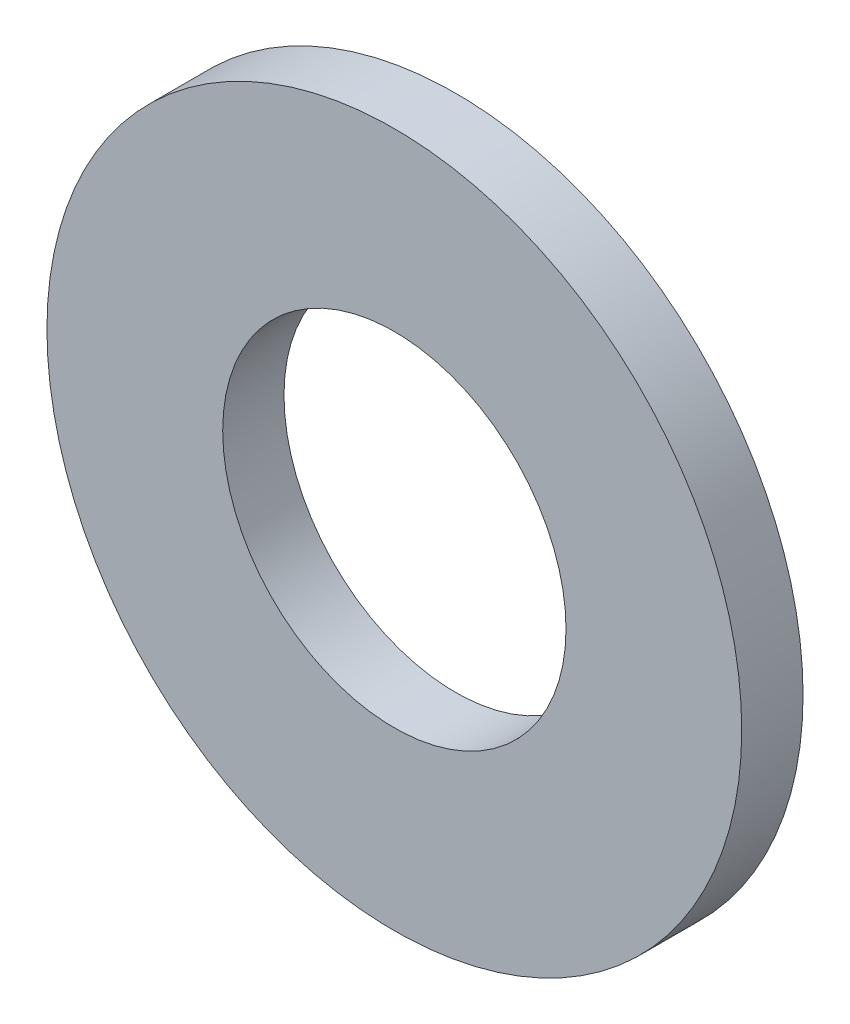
ISO-10303-21;
HEADER;
FILE_DESCRIPTION(('STEP AP214'),'2;1');
FILE_NAME('part.step','',(''),(''),'','','');
FILE_SCHEMA(('AUTOMOTIVE_DESIGN { 1 0 10303 214 1 1 1 1 }'));
ENDSEC;
DATA;
#1=APPLICATION_CONTEXT('core data for automotive mechanical design processes');
#2=APPLICATION_PROTOCOL_DEFINITION('international standard','automotive_design',2000,#1);
#3=PRODUCT_CONTEXT('',#1,'mechanical');
#4=PRODUCT('Part','Part','',(#3));
#5=PRODUCT_RELATED_PRODUCT_CATEGORY('part','',(#4));
#6=PRODUCT_DEFINITION_FORMATION('','',#4);
#7=PRODUCT_DEFINITION_CONTEXT('part definition',#1,'design');
#8=PRODUCT_DEFINITION('design','',#6,#7);
#9=PRODUCT_DEFINITION_SHAPE('','',#8);
#10=(LENGTH_UNIT() NAMED_UNIT(*) SI_UNIT(.MILLI.,.METRE.));
#11=(NAMED_UNIT(*) PLANE_ANGLE_UNIT() SI_UNIT($,.RADIAN.));
#12=(NAMED_UNIT(*) SI_UNIT($,.STERADIAN.) SOLID_ANGLE_UNIT());
#13=UNCERTAINTY_MEASURE_WITH_UNIT(LENGTH_MEASURE(1.E-05),#10,'distance_accuracy_value','');
#14=(GEOMETRIC_REPRESENTATION_CONTEXT(3) GLOBAL_UNCERTAINTY_ASSIGNED_CONTEXT((#13)) GLOBAL_UNIT_ASSIGNED_CONTEXT((#10,
#11,#12)) REPRESENTATION_CONTEXT('',''));
#15=CARTESIAN_POINT('',(0.,0.,0.));
#16=DIRECTION('',(0.,0.,1.));
#17=DIRECTION('',(1.,0.,0.));
#18=AXIS2_PLACEMENT_3D('',#15,#16,#17);
#19=CARTESIAN_POINT('',(0.,0.,1.5));
#20=DIRECTION('',(0.,0.,1.));
#21=DIRECTION('',(1.,0.,0.));
#22=AXIS2_PLACEMENT_3D('',#19,#20,#21);
#23=PLANE('',#22);
#24=CARTESIAN_POINT('',(0.,0.,1.5));
#25=DIRECTION('',(0.,0.,1.));
#26=DIRECTION('',(1.,0.,0.));
#27=AXIS2_PLACEMENT_3D('',#24,#25,#26);
#28=CIRCLE('',#27,8.5);
#29=CARTESIAN_POINT('',(8.5,0.,1.5));
#30=VERTEX_POINT('',#29);
#31=EDGE_CURVE('E8',#30,#30,#28,.T.);
#32=ORIENTED_EDGE('',*,*,#31,.T.);
#33=EDGE_LOOP('',(#32));
#34=FACE_BOUND('',#33,.T.);
#35=CARTESIAN_POINT('',(0.,0.,1.5));
#36=DIRECTION('',(0.,0.,1.));
#37=DIRECTION('',(1.,0.,0.));
#38=AXIS2_PLACEMENT_3D('',#35,#36,#37);
#39=CIRCLE('',#38,4.2);
#40=CARTESIAN_POINT('',(4.2,0.,1.5));
#41=VERTEX_POINT('',#40);
#42=EDGE_CURVE('E23',#41,#41,#39,.T.);
#43=ORIENTED_EDGE('',*,*,#42,.F.);
#44=EDGE_LOOP('',(#43));
#45=FACE_BOUND('',#44,.T.);
#46=ADVANCED_FACE('F12',(#34,#45),#23,.T.);
#47=CARTESIAN_POINT('',(0.,0.,0.));
#48=DIRECTION('',(0.,0.,1.));
#49=DIRECTION('',(1.,0.,0.));
#50=AXIS2_PLACEMENT_3D('',#47,#48,#49);
#51=PLANE('',#50);
#52=CARTESIAN_POINT('',(0.,0.,0.));
#53=DIRECTION('',(0.,0.,1.));
#54=DIRECTION('',(1.,0.,0.));
#55=AXIS2_PLACEMENT_3D('',#52,#53,#54);
#56=CIRCLE('',#55,8.5);
#57=CARTESIAN_POINT('',(8.5,0.,0.));
#58=VERTEX_POINT('',#57);
#59=EDGE_CURVE('E16',#58,#58,#56,.T.);
#60=ORIENTED_EDGE('',*,*,#59,.F.);
#61=EDGE_LOOP('',(#60));
#62=FACE_BOUND('',#61,.T.);
#63=CARTESIAN_POINT('',(0.,0.,0.));
#64=DIRECTION('',(0.,0.,1.));
#65=DIRECTION('',(1.,0.,0.));
#66=AXIS2_PLACEMENT_3D('',#63,#64,#65);
#67=CIRCLE('',#66,4.2);
#68=CARTESIAN_POINT('',(4.2,0.,0.));
#69=VERTEX_POINT('',#68);
#70=EDGE_CURVE('E25',#69,#69,#67,.T.);
#71=ORIENTED_EDGE('',*,*,#70,.T.);
#72=EDGE_LOOP('',(#71));
#73=FACE_BOUND('',#72,.T.);
#74=ADVANCED_FACE('F35',(#62,#73),#51,.F.);
#75=CARTESIAN_POINT('',(0.,0.,1.5));
#76=DIRECTION('',(0.,0.,-1.));
#77=DIRECTION('',(-1.,0.,0.));
#78=AXIS2_PLACEMENT_3D('',#75,#76,#77);
#79=CYLINDRICAL_SURFACE('',#78,8.5);
#80=ORIENTED_EDGE('',*,*,#31,.F.);
#81=EDGE_LOOP('',(#80));
#82=FACE_BOUND('',#81,.T.);
#83=ORIENTED_EDGE('',*,*,#59,.T.);
#84=EDGE_LOOP('',(#83));
#85=FACE_BOUND('',#84,.T.);
#86=ADVANCED_FACE('F14',(#82,#85),#79,.T.);
#87=CARTESIAN_POINT('',(0.,0.,1.5));
#88=DIRECTION('',(0.,0.,-1.));
#89=DIRECTION('',(-1.,0.,0.));
#90=AXIS2_PLACEMENT_3D('',#87,#88,#89);
#91=CYLINDRICAL_SURFACE('',#90,4.2);
#92=ORIENTED_EDGE('',*,*,#42,.T.);
#93=EDGE_LOOP('',(#92));
#94=FACE_BOUND('',#93,.T.);
#95=ORIENTED_EDGE('',*,*,#70,.F.);
#96=EDGE_LOOP('',(#95));
#97=FACE_BOUND('',#96,.T.);
#98=ADVANCED_FACE('F31',(#94,#97),#91,.F.);
#99=CLOSED_SHELL('',(#46,#74,#86,#98));
#100=MANIFOLD_SOLID_BREP('B1',#99);
#101=ADVANCED_BREP_SHAPE_REPRESENTATION('',(#18,#100),#14);
#102=SHAPE_DEFINITION_REPRESENTATION(#9,#101);
ENDSEC;
END-ISO-10303-21;
